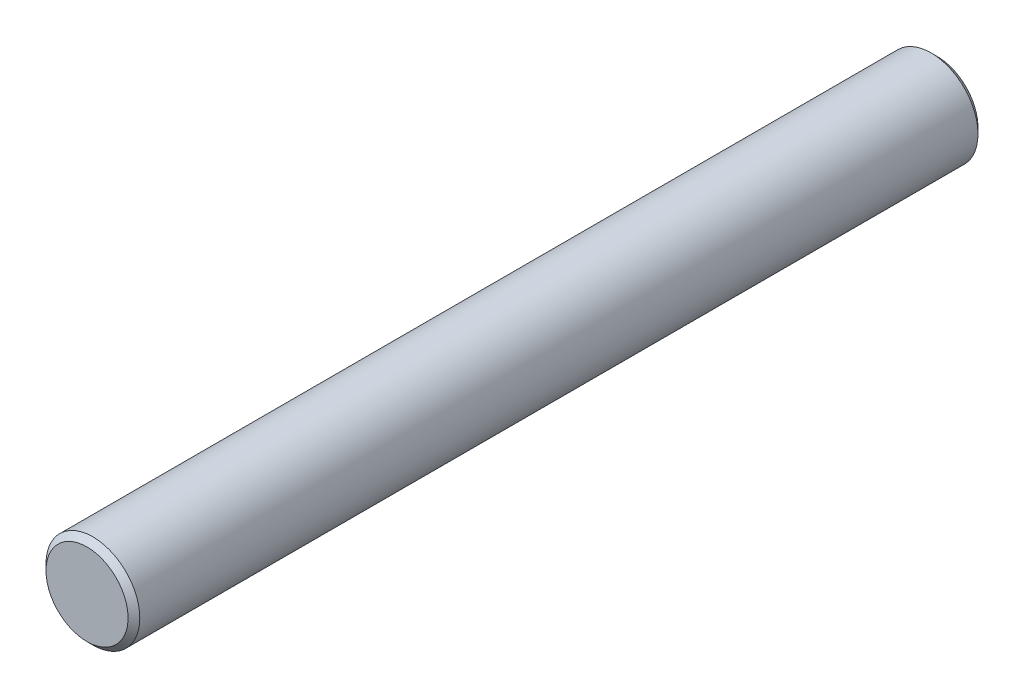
ISO-10303-21;
HEADER;
FILE_DESCRIPTION(('STEP AP214'),'2;1');
FILE_NAME('part.step','',(''),(''),'','','');
FILE_SCHEMA(('AUTOMOTIVE_DESIGN { 1 0 10303 214 1 1 1 1 }'));
ENDSEC;
DATA;
#1=APPLICATION_CONTEXT('core data for automotive mechanical design processes');
#2=APPLICATION_PROTOCOL_DEFINITION('international standard','automotive_design',2000,#1);
#3=PRODUCT_CONTEXT('',#1,'mechanical');
#4=PRODUCT('Part','Part','',(#3));
#5=PRODUCT_RELATED_PRODUCT_CATEGORY('part','',(#4));
#6=PRODUCT_DEFINITION_FORMATION('','',#4);
#7=PRODUCT_DEFINITION_CONTEXT('part definition',#1,'design');
#8=PRODUCT_DEFINITION('design','',#6,#7);
#9=PRODUCT_DEFINITION_SHAPE('','',#8);
#10=(LENGTH_UNIT() NAMED_UNIT(*) SI_UNIT(.MILLI.,.METRE.));
#11=(NAMED_UNIT(*) PLANE_ANGLE_UNIT() SI_UNIT($,.RADIAN.));
#12=(NAMED_UNIT(*) SI_UNIT($,.STERADIAN.) SOLID_ANGLE_UNIT());
#13=UNCERTAINTY_MEASURE_WITH_UNIT(LENGTH_MEASURE(1.E-05),#10,'distance_accuracy_value','');
#14=(GEOMETRIC_REPRESENTATION_CONTEXT(3) GLOBAL_UNCERTAINTY_ASSIGNED_CONTEXT((#13)) GLOBAL_UNIT_ASSIGNED_CONTEXT((#10,
#11,#12)) REPRESENTATION_CONTEXT('',''));
#15=CARTESIAN_POINT('',(0.,0.,0.));
#16=DIRECTION('',(0.,0.,1.));
#17=DIRECTION('',(1.,0.,0.));
#18=AXIS2_PLACEMENT_3D('',#15,#16,#17);
#19=CARTESIAN_POINT('',(-4.013464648,-12.017113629,8.));
#20=DIRECTION('',(0.,0.,1.));
#21=DIRECTION('',(0.997032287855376,-0.0769845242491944,0.));
#22=AXIS2_PLACEMENT_3D('',#19,#20,#21);
#23=PLANE('',#22);
#24=CARTESIAN_POINT('',(-3.252631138,-11.365351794,8.00000000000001));
#25=DIRECTION('',(0.,0.,-1.));
#26=DIRECTION('',(-1.,0.,0.));
#27=AXIS2_PLACEMENT_3D('',#24,#25,#26);
#28=CIRCLE('',#27,0.699999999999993);
#29=CARTESIAN_POINT('',(-3.95263113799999,-11.365351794,8.00000000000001));
#30=VERTEX_POINT('',#29);
#31=EDGE_CURVE('E19',#30,#30,#28,.F.);
#32=ORIENTED_EDGE('',*,*,#31,.T.);
#33=EDGE_LOOP('',(#32));
#34=FACE_BOUND('',#33,.T.);
#35=ADVANCED_FACE('F15',(#34),#23,.T.);
#36=CARTESIAN_POINT('',(-3.252631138,-11.365351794,8.));
#37=DIRECTION('',(0.,0.,-1.));
#38=DIRECTION('',(-1.,0.,0.));
#39=AXIS2_PLACEMENT_3D('',#36,#37,#38);
#40=CONICAL_SURFACE('',#39,0.7,0.785398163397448);
#41=CARTESIAN_POINT('',(-3.252631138,-11.365351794,7.9));
#42=DIRECTION('',(0.,0.,1.));
#43=DIRECTION('',(1.,0.,0.));
#44=AXIS2_PLACEMENT_3D('',#41,#42,#43);
#45=CIRCLE('',#44,0.8);
#46=CARTESIAN_POINT('',(-2.452631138,-11.365351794,7.9));
#47=VERTEX_POINT('',#46);
#48=EDGE_CURVE('E27',#47,#47,#45,.T.);
#49=ORIENTED_EDGE('',*,*,#48,.T.);
#50=EDGE_LOOP('',(#49));
#51=FACE_BOUND('',#50,.T.);
#52=ORIENTED_EDGE('',*,*,#31,.F.);
#53=EDGE_LOOP('',(#52));
#54=FACE_BOUND('',#53,.T.);
#55=ADVANCED_FACE('F37',(#51,#54),#40,.T.);
#56=CARTESIAN_POINT('',(-3.252631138,-11.365351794,-6.4));
#57=DIRECTION('',(0.,0.,1.));
#58=DIRECTION('',(1.,0.,0.));
#59=AXIS2_PLACEMENT_3D('',#56,#57,#58);
#60=CYLINDRICAL_SURFACE('',#59,0.8);
#61=ORIENTED_EDGE('',*,*,#48,.F.);
#62=EDGE_LOOP('',(#61));
#63=FACE_BOUND('',#62,.T.);
#64=CARTESIAN_POINT('',(-3.252631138,-11.365351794,-6.39999999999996));
#65=DIRECTION('',(0.,0.,1.));
#66=DIRECTION('',(1.,0.,0.));
#67=AXIS2_PLACEMENT_3D('',#64,#65,#66);
#68=CIRCLE('',#67,0.8);
#69=CARTESIAN_POINT('',(-2.452631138,-11.365351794,-6.4));
#70=VERTEX_POINT('',#69);
#71=EDGE_CURVE('E23',#70,#70,#68,.T.);
#72=ORIENTED_EDGE('',*,*,#71,.T.);
#73=EDGE_LOOP('',(#72));
#74=FACE_BOUND('',#73,.T.);
#75=ADVANCED_FACE('F39',(#63,#74),#60,.T.);
#76=CARTESIAN_POINT('',(-3.961031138,-12.073751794,-6.5));
#77=DIRECTION('',(0.,0.,1.));
#78=DIRECTION('',(1.,0.,0.));
#79=AXIS2_PLACEMENT_3D('',#76,#77,#78);
#80=PLANE('',#79);
#81=CARTESIAN_POINT('',(-3.252631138,-11.365351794,-6.49999999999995));
#82=DIRECTION('',(0.,0.,1.));
#83=DIRECTION('',(0.,-1.,0.));
#84=AXIS2_PLACEMENT_3D('',#81,#82,#83);
#85=CIRCLE('',#84,0.70000000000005);
#86=CARTESIAN_POINT('',(-3.252631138,-12.0653517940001,-6.49999999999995));
#87=VERTEX_POINT('',#86);
#88=EDGE_CURVE('E10',#87,#87,#85,.F.);
#89=ORIENTED_EDGE('',*,*,#88,.T.);
#90=EDGE_LOOP('',(#89));
#91=FACE_BOUND('',#90,.T.);
#92=ADVANCED_FACE('F17',(#91),#80,.F.);
#93=CARTESIAN_POINT('',(-3.252631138,-11.365351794,-6.5));
#94=DIRECTION('',(0.,0.,1.));
#95=DIRECTION('',(0.,-1.,0.));
#96=AXIS2_PLACEMENT_3D('',#93,#94,#95);
#97=CONICAL_SURFACE('',#96,0.7,0.785398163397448);
#98=ORIENTED_EDGE('',*,*,#88,.F.);
#99=EDGE_LOOP('',(#98));
#100=FACE_BOUND('',#99,.T.);
#101=ORIENTED_EDGE('',*,*,#71,.F.);
#102=EDGE_LOOP('',(#101));
#103=FACE_BOUND('',#102,.T.);
#104=ADVANCED_FACE('F49',(#100,#103),#97,.T.);
#105=CLOSED_SHELL('',(#35,#55,#75,#92,#104));
#106=MANIFOLD_SOLID_BREP('B1',#105);
#107=ADVANCED_BREP_SHAPE_REPRESENTATION('',(#18,#106),#14);
#108=SHAPE_DEFINITION_REPRESENTATION(#9,#107);
ENDSEC;
END-ISO-10303-21;
